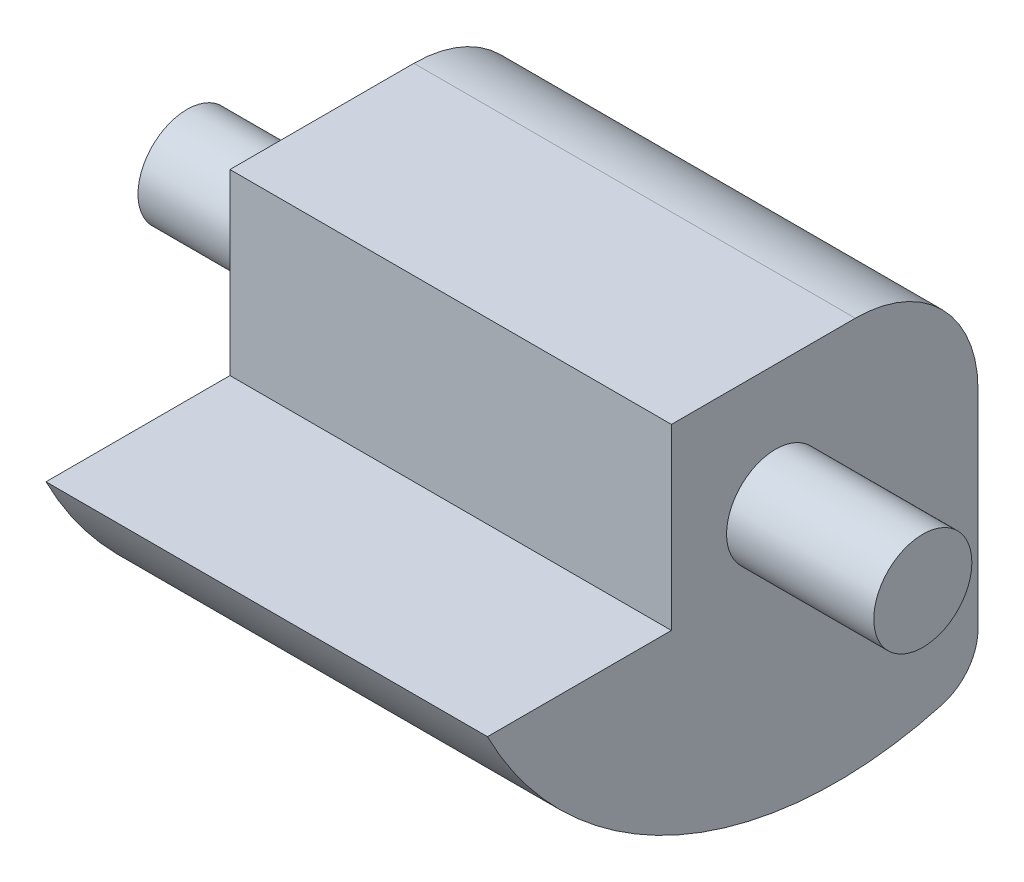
ISO-10303-21;
HEADER;
FILE_DESCRIPTION(('STEP AP214'),'2;1');
FILE_NAME('part.step','',(''),(''),'','','');
FILE_SCHEMA(('AUTOMOTIVE_DESIGN { 1 0 10303 214 1 1 1 1 }'));
ENDSEC;
DATA;
#1=APPLICATION_CONTEXT('core data for automotive mechanical design processes');
#2=APPLICATION_PROTOCOL_DEFINITION('international standard','automotive_design',2000,#1);
#3=PRODUCT_CONTEXT('',#1,'mechanical');
#4=PRODUCT('Part','Part','',(#3));
#5=PRODUCT_RELATED_PRODUCT_CATEGORY('part','',(#4));
#6=PRODUCT_DEFINITION_FORMATION('','',#4);
#7=PRODUCT_DEFINITION_CONTEXT('part definition',#1,'design');
#8=PRODUCT_DEFINITION('design','',#6,#7);
#9=PRODUCT_DEFINITION_SHAPE('','',#8);
#10=(LENGTH_UNIT() NAMED_UNIT(*) SI_UNIT(.MILLI.,.METRE.));
#11=(NAMED_UNIT(*) PLANE_ANGLE_UNIT() SI_UNIT($,.RADIAN.));
#12=(NAMED_UNIT(*) SI_UNIT($,.STERADIAN.) SOLID_ANGLE_UNIT());
#13=UNCERTAINTY_MEASURE_WITH_UNIT(LENGTH_MEASURE(1.E-05),#10,'distance_accuracy_value','');
#14=(GEOMETRIC_REPRESENTATION_CONTEXT(3) GLOBAL_UNCERTAINTY_ASSIGNED_CONTEXT((#13)) GLOBAL_UNIT_ASSIGNED_CONTEXT((#10,
#11,#12)) REPRESENTATION_CONTEXT('',''));
#15=CARTESIAN_POINT('',(0.,0.,0.));
#16=DIRECTION('',(0.,0.,1.));
#17=DIRECTION('',(1.,0.,0.));
#18=AXIS2_PLACEMENT_3D('',#15,#16,#17);
#19=CARTESIAN_POINT('',(1.82178280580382,25.230124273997,86.6124482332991));
#20=DIRECTION('',(0.,0.,1.));
#21=DIRECTION('',(1.,0.,0.));
#22=AXIS2_PLACEMENT_3D('',#19,#20,#21);
#23=PLANE('',#22);
#24=DIRECTION('',(1.,0.,0.));
#25=VECTOR('',#24,1.);
#26=CARTESIAN_POINT('',(1.82178280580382,17.9543081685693,86.6124482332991));
#27=LINE('',#26,#25);
#28=CARTESIAN_POINT('',(1.82178280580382,17.9543081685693,86.6124482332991));
#29=VERTEX_POINT('',#28);
#30=CARTESIAN_POINT('',(19.8217828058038,17.9543081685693,86.6124482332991));
#31=VERTEX_POINT('',#30);
#32=EDGE_CURVE('E90',#29,#31,#27,.T.);
#33=ORIENTED_EDGE('',*,*,#32,.T.);
#34=DIRECTION('',(0.,-1.,0.));
#35=VECTOR('',#34,1.);
#36=CARTESIAN_POINT('',(19.8217828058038,25.230124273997,86.6124482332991));
#37=LINE('',#36,#35);
#38=CARTESIAN_POINT('',(19.8217828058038,25.230124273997,86.6124482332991));
#39=VERTEX_POINT('',#38);
#40=EDGE_CURVE('E94',#39,#31,#37,.T.);
#41=ORIENTED_EDGE('',*,*,#40,.F.);
#42=DIRECTION('',(1.,0.,0.));
#43=VECTOR('',#42,1.);
#44=CARTESIAN_POINT('',(1.82178280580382,25.230124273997,86.6124482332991));
#45=LINE('',#44,#43);
#46=CARTESIAN_POINT('',(1.82178280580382,25.230124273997,86.6124482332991));
#47=VERTEX_POINT('',#46);
#48=EDGE_CURVE('E133',#47,#39,#45,.T.);
#49=ORIENTED_EDGE('',*,*,#48,.F.);
#50=DIRECTION('',(0.,-1.,0.));
#51=VECTOR('',#50,1.);
#52=CARTESIAN_POINT('',(1.82178280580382,25.230124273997,86.6124482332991));
#53=LINE('',#52,#51);
#54=EDGE_CURVE('E96',#47,#29,#53,.T.);
#55=ORIENTED_EDGE('',*,*,#54,.T.);
#56=EDGE_LOOP('',(#33,#41,#49,#55));
#57=FACE_BOUND('',#56,.T.);
#58=ADVANCED_FACE('F33',(#57),#23,.T.);
#59=CARTESIAN_POINT('',(1.82178280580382,25.230124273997,86.6124482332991));
#60=DIRECTION('',(0.,1.,0.));
#61=DIRECTION('',(0.,0.,1.));
#62=AXIS2_PLACEMENT_3D('',#59,#60,#61);
#63=PLANE('',#62);
#64=DIRECTION('',(0.,0.,1.));
#65=VECTOR('',#64,1.);
#66=CARTESIAN_POINT('',(19.8217828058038,25.230124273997,86.6124482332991));
#67=LINE('',#66,#65);
#68=CARTESIAN_POINT('',(19.8217828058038,25.230124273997,79.1124482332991));
#69=VERTEX_POINT('',#68);
#70=EDGE_CURVE('E111',#69,#39,#67,.T.);
#71=ORIENTED_EDGE('',*,*,#70,.F.);
#72=DIRECTION('',(1.,0.,0.));
#73=VECTOR('',#72,1.);
#74=CARTESIAN_POINT('',(1.82178280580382,25.230124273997,79.1124482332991));
#75=LINE('',#74,#73);
#76=CARTESIAN_POINT('',(1.82178280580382,25.230124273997,79.1124482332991));
#77=VERTEX_POINT('',#76);
#78=EDGE_CURVE('E144',#69,#77,#75,.F.);
#79=ORIENTED_EDGE('',*,*,#78,.T.);
#80=DIRECTION('',(0.,0.,1.));
#81=VECTOR('',#80,1.);
#82=CARTESIAN_POINT('',(1.82178280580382,25.230124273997,86.6124482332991));
#83=LINE('',#82,#81);
#84=EDGE_CURVE('E101',#77,#47,#83,.T.);
#85=ORIENTED_EDGE('',*,*,#84,.T.);
#86=ORIENTED_EDGE('',*,*,#48,.T.);
#87=EDGE_LOOP('',(#71,#79,#85,#86));
#88=FACE_BOUND('',#87,.T.);
#89=ADVANCED_FACE('F169',(#88),#63,.T.);
#90=CARTESIAN_POINT('',(1.82178280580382,25.230124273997,74.1124482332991));
#91=DIRECTION('',(0.,0.,-1.));
#92=DIRECTION('',(-1.,0.,0.));
#93=AXIS2_PLACEMENT_3D('',#90,#91,#92);
#94=PLANE('',#93);
#95=DIRECTION('',(0.,1.,0.));
#96=VECTOR('',#95,1.);
#97=CARTESIAN_POINT('',(19.8217828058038,25.230124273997,74.1124482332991));
#98=LINE('',#97,#96);
#99=CARTESIAN_POINT('',(19.8217828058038,11.7417033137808,74.1124482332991));
#100=VERTEX_POINT('',#99);
#101=CARTESIAN_POINT('',(19.8217828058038,20.230124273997,74.1124482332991));
#102=VERTEX_POINT('',#101);
#103=EDGE_CURVE('E121',#100,#102,#98,.T.);
#104=ORIENTED_EDGE('',*,*,#103,.F.);
#105=DIRECTION('',(1.,0.,0.));
#106=VECTOR('',#105,1.);
#107=CARTESIAN_POINT('',(1.82178280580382,11.7417033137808,74.1124482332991));
#108=LINE('',#107,#106);
#109=CARTESIAN_POINT('',(1.82178280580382,11.7417033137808,74.1124482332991));
#110=VERTEX_POINT('',#109);
#111=EDGE_CURVE('E41',#100,#110,#108,.F.);
#112=ORIENTED_EDGE('',*,*,#111,.T.);
#113=DIRECTION('',(0.,1.,0.));
#114=VECTOR('',#113,1.);
#115=CARTESIAN_POINT('',(1.82178280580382,25.230124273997,74.1124482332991));
#116=LINE('',#115,#114);
#117=CARTESIAN_POINT('',(1.82178280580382,20.230124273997,74.1124482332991));
#118=VERTEX_POINT('',#117);
#119=EDGE_CURVE('E130',#110,#118,#116,.T.);
#120=ORIENTED_EDGE('',*,*,#119,.T.);
#121=DIRECTION('',(1.,0.,0.));
#122=VECTOR('',#121,1.);
#123=CARTESIAN_POINT('',(1.82178280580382,20.230124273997,74.1124482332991));
#124=LINE('',#123,#122);
#125=EDGE_CURVE('E139',#118,#102,#124,.T.);
#126=ORIENTED_EDGE('',*,*,#125,.T.);
#127=EDGE_LOOP('',(#104,#112,#120,#126));
#128=FACE_BOUND('',#127,.T.);
#129=ADVANCED_FACE('F163',(#128),#94,.T.);
#130=CARTESIAN_POINT('',(1.82178280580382,25.230124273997,79.8624482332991));
#131=DIRECTION('',(1.,0.,0.));
#132=DIRECTION('',(0.,0.,-1.));
#133=AXIS2_PLACEMENT_3D('',#130,#131,#132);
#134=CYLINDRICAL_SURFACE('',#133,16.);
#135=CARTESIAN_POINT('',(1.82178280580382,25.230124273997,79.8624482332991));
#136=DIRECTION('',(1.,0.,0.));
#137=DIRECTION('',(0.,0.,-1.));
#138=AXIS2_PLACEMENT_3D('',#135,#136,#137);
#139=CIRCLE('',#138,16.);
#140=CARTESIAN_POINT('',(1.82178280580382,17.9543081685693,94.112448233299));
#141=VERTEX_POINT('',#140);
#142=CARTESIAN_POINT('',(1.82178280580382,9.81478603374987,75.5767339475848));
#143=VERTEX_POINT('',#142);
#144=EDGE_CURVE('E127',#141,#143,#139,.T.);
#145=ORIENTED_EDGE('',*,*,#144,.T.);
#146=DIRECTION('',(1.,0.,0.));
#147=VECTOR('',#146,1.);
#148=CARTESIAN_POINT('',(1.82178280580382,9.81478603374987,75.5767339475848));
#149=LINE('',#148,#147);
#150=CARTESIAN_POINT('',(19.8217828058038,9.81478603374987,75.5767339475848));
#151=VERTEX_POINT('',#150);
#152=EDGE_CURVE('E149',#143,#151,#149,.T.);
#153=ORIENTED_EDGE('',*,*,#152,.T.);
#154=CARTESIAN_POINT('',(19.8217828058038,25.230124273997,79.8624482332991));
#155=DIRECTION('',(1.,0.,0.));
#156=DIRECTION('',(0.,0.,-1.));
#157=AXIS2_PLACEMENT_3D('',#154,#155,#156);
#158=CIRCLE('',#157,16.);
#159=CARTESIAN_POINT('',(19.8217828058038,17.9543081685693,94.112448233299));
#160=VERTEX_POINT('',#159);
#161=EDGE_CURVE('E107',#160,#151,#158,.T.);
#162=ORIENTED_EDGE('',*,*,#161,.F.);
#163=DIRECTION('',(1.,0.,0.));
#164=VECTOR('',#163,1.);
#165=CARTESIAN_POINT('',(1.82178280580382,17.9543081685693,94.112448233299));
#166=LINE('',#165,#164);
#167=EDGE_CURVE('E100',#141,#160,#166,.T.);
#168=ORIENTED_EDGE('',*,*,#167,.F.);
#169=EDGE_LOOP('',(#145,#153,#162,#168));
#170=FACE_BOUND('',#169,.T.);
#171=ADVANCED_FACE('F154',(#170),#134,.T.);
#172=CARTESIAN_POINT('',(1.82178280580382,17.9543081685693,86.6124482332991));
#173=DIRECTION('',(0.,1.,0.));
#174=DIRECTION('',(0.,0.,1.));
#175=AXIS2_PLACEMENT_3D('',#172,#173,#174);
#176=PLANE('',#175);
#177=ORIENTED_EDGE('',*,*,#167,.T.);
#178=DIRECTION('',(0.,0.,1.));
#179=VECTOR('',#178,1.);
#180=CARTESIAN_POINT('',(19.8217828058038,17.9543081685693,86.6124482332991));
#181=LINE('',#180,#179);
#182=EDGE_CURVE('E104',#31,#160,#181,.T.);
#183=ORIENTED_EDGE('',*,*,#182,.F.);
#184=ORIENTED_EDGE('',*,*,#32,.F.);
#185=DIRECTION('',(0.,0.,1.));
#186=VECTOR('',#185,1.);
#187=CARTESIAN_POINT('',(1.82178280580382,17.9543081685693,86.6124482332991));
#188=LINE('',#187,#186);
#189=EDGE_CURVE('E125',#29,#141,#188,.T.);
#190=ORIENTED_EDGE('',*,*,#189,.T.);
#191=EDGE_LOOP('',(#177,#183,#184,#190));
#192=FACE_BOUND('',#191,.T.);
#193=ADVANCED_FACE('F105',(#192),#176,.T.);
#194=CARTESIAN_POINT('',(1.82178280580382,25.230124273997,79.8624482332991));
#195=DIRECTION('',(1.,0.,0.));
#196=DIRECTION('',(0.,0.,-1.));
#197=AXIS2_PLACEMENT_3D('',#194,#195,#196);
#198=PLANE('',#197);
#199=CARTESIAN_POINT('',(1.82178280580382,20.230124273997,82.3624482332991));
#200=DIRECTION('',(1.,0.,0.));
#201=DIRECTION('',(0.,0.,-1.));
#202=AXIS2_PLACEMENT_3D('',#199,#200,#201);
#203=CIRCLE('',#202,2.);
#204=CARTESIAN_POINT('',(1.82178280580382,20.230124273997,80.3624482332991));
#205=VERTEX_POINT('',#204);
#206=EDGE_CURVE('E135',#205,#205,#203,.F.);
#207=ORIENTED_EDGE('',*,*,#206,.F.);
#208=EDGE_LOOP('',(#207));
#209=FACE_BOUND('',#208,.T.);
#210=ORIENTED_EDGE('',*,*,#119,.F.);
#211=CARTESIAN_POINT('',(1.82178280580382,11.7417033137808,76.1124482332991));
#212=DIRECTION('',(1.,0.,0.));
#213=DIRECTION('',(0.,0.,-1.));
#214=AXIS2_PLACEMENT_3D('',#211,#212,#213);
#215=CIRCLE('',#214,2.);
#216=EDGE_CURVE('E11',#110,#143,#215,.F.);
#217=ORIENTED_EDGE('',*,*,#216,.T.);
#218=ORIENTED_EDGE('',*,*,#144,.F.);
#219=ORIENTED_EDGE('',*,*,#189,.F.);
#220=ORIENTED_EDGE('',*,*,#54,.F.);
#221=ORIENTED_EDGE('',*,*,#84,.F.);
#222=CARTESIAN_POINT('',(1.82178280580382,20.230124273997,79.1124482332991));
#223=DIRECTION('',(1.,0.,0.));
#224=DIRECTION('',(0.,0.,-1.));
#225=AXIS2_PLACEMENT_3D('',#222,#223,#224);
#226=CIRCLE('',#225,5.);
#227=EDGE_CURVE('E146',#77,#118,#226,.F.);
#228=ORIENTED_EDGE('',*,*,#227,.T.);
#229=EDGE_LOOP('',(#210,#217,#218,#219,#220,#221,#228));
#230=FACE_BOUND('',#229,.T.);
#231=ADVANCED_FACE('F159',(#209,#230),#198,.F.);
#232=CARTESIAN_POINT('',(19.8217828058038,25.230124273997,79.8624482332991));
#233=DIRECTION('',(1.,0.,0.));
#234=DIRECTION('',(0.,0.,-1.));
#235=AXIS2_PLACEMENT_3D('',#232,#233,#234);
#236=PLANE('',#235);
#237=CARTESIAN_POINT('',(19.8217828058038,20.230124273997,82.3624482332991));
#238=DIRECTION('',(1.,0.,0.));
#239=DIRECTION('',(0.,0.,-1.));
#240=AXIS2_PLACEMENT_3D('',#237,#238,#239);
#241=CIRCLE('',#240,2.);
#242=CARTESIAN_POINT('',(19.8217828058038,20.230124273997,80.3624482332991));
#243=VERTEX_POINT('',#242);
#244=EDGE_CURVE('E215',#243,#243,#241,.T.);
#245=ORIENTED_EDGE('',*,*,#244,.F.);
#246=EDGE_LOOP('',(#245));
#247=FACE_BOUND('',#246,.T.);
#248=ORIENTED_EDGE('',*,*,#161,.T.);
#249=CARTESIAN_POINT('',(19.8217828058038,11.7417033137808,76.1124482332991));
#250=DIRECTION('',(1.,0.,0.));
#251=DIRECTION('',(0.,0.,-1.));
#252=AXIS2_PLACEMENT_3D('',#249,#250,#251);
#253=CIRCLE('',#252,2.);
#254=EDGE_CURVE('E55',#151,#100,#253,.T.);
#255=ORIENTED_EDGE('',*,*,#254,.T.);
#256=ORIENTED_EDGE('',*,*,#103,.T.);
#257=CARTESIAN_POINT('',(19.8217828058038,20.230124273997,79.1124482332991));
#258=DIRECTION('',(1.,0.,0.));
#259=DIRECTION('',(0.,0.,-1.));
#260=AXIS2_PLACEMENT_3D('',#257,#258,#259);
#261=CIRCLE('',#260,5.);
#262=EDGE_CURVE('E142',#102,#69,#261,.T.);
#263=ORIENTED_EDGE('',*,*,#262,.T.);
#264=ORIENTED_EDGE('',*,*,#70,.T.);
#265=ORIENTED_EDGE('',*,*,#40,.T.);
#266=ORIENTED_EDGE('',*,*,#182,.T.);
#267=EDGE_LOOP('',(#248,#255,#256,#263,#264,#265,#266));
#268=FACE_BOUND('',#267,.T.);
#269=ADVANCED_FACE('F109',(#247,#268),#236,.T.);
#270=CARTESIAN_POINT('',(-4.17821719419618,20.230124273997,82.3624482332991));
#271=DIRECTION('',(1.,0.,0.));
#272=DIRECTION('',(0.,0.,-1.));
#273=AXIS2_PLACEMENT_3D('',#270,#271,#272);
#274=CYLINDRICAL_SURFACE('',#273,2.);
#275=CARTESIAN_POINT('',(-4.17821719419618,20.230124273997,82.3624482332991));
#276=DIRECTION('',(-1.,0.,0.));
#277=DIRECTION('',(0.,0.,1.));
#278=AXIS2_PLACEMENT_3D('',#275,#276,#277);
#279=CIRCLE('',#278,2.);
#280=CARTESIAN_POINT('',(-4.17821719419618,20.230124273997,84.3624482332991));
#281=VERTEX_POINT('',#280);
#282=EDGE_CURVE('E113',#281,#281,#279,.T.);
#283=ORIENTED_EDGE('',*,*,#282,.F.);
#284=EDGE_LOOP('',(#283));
#285=FACE_BOUND('',#284,.T.);
#286=ORIENTED_EDGE('',*,*,#206,.T.);
#287=EDGE_LOOP('',(#286));
#288=FACE_BOUND('',#287,.T.);
#289=ADVANCED_FACE('F203',(#285,#288),#274,.T.);
#290=CARTESIAN_POINT('',(-4.17821719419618,20.230124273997,82.3624482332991));
#291=DIRECTION('',(-1.,0.,0.));
#292=DIRECTION('',(0.,0.,1.));
#293=AXIS2_PLACEMENT_3D('',#290,#291,#292);
#294=PLANE('',#293);
#295=ORIENTED_EDGE('',*,*,#282,.T.);
#296=EDGE_LOOP('',(#295));
#297=FACE_BOUND('',#296,.T.);
#298=ADVANCED_FACE('F196',(#297),#294,.T.);
#299=CARTESIAN_POINT('',(25.8217828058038,20.230124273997,82.3624482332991));
#300=DIRECTION('',(-1.,0.,0.));
#301=DIRECTION('',(0.,0.,1.));
#302=AXIS2_PLACEMENT_3D('',#299,#300,#301);
#303=CYLINDRICAL_SURFACE('',#302,2.);
#304=CARTESIAN_POINT('',(25.8217828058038,20.230124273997,82.3624482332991));
#305=DIRECTION('',(1.,0.,0.));
#306=DIRECTION('',(0.,0.,-1.));
#307=AXIS2_PLACEMENT_3D('',#304,#305,#306);
#308=CIRCLE('',#307,2.);
#309=CARTESIAN_POINT('',(25.8217828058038,20.230124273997,80.3624482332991));
#310=VERTEX_POINT('',#309);
#311=EDGE_CURVE('E116',#310,#310,#308,.T.);
#312=ORIENTED_EDGE('',*,*,#311,.F.);
#313=EDGE_LOOP('',(#312));
#314=FACE_BOUND('',#313,.T.);
#315=ORIENTED_EDGE('',*,*,#244,.T.);
#316=EDGE_LOOP('',(#315));
#317=FACE_BOUND('',#316,.T.);
#318=ADVANCED_FACE('F190',(#314,#317),#303,.T.);
#319=CARTESIAN_POINT('',(25.8217828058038,20.230124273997,82.3624482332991));
#320=DIRECTION('',(1.,0.,0.));
#321=DIRECTION('',(0.,0.,-1.));
#322=AXIS2_PLACEMENT_3D('',#319,#320,#321);
#323=PLANE('',#322);
#324=ORIENTED_EDGE('',*,*,#311,.T.);
#325=EDGE_LOOP('',(#324));
#326=FACE_BOUND('',#325,.T.);
#327=ADVANCED_FACE('F185',(#326),#323,.T.);
#328=CARTESIAN_POINT('',(1.82178280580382,20.230124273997,79.1124482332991));
#329=DIRECTION('',(1.,0.,0.));
#330=DIRECTION('',(0.,0.,-1.));
#331=AXIS2_PLACEMENT_3D('',#328,#329,#330);
#332=CYLINDRICAL_SURFACE('',#331,5.);
#333=ORIENTED_EDGE('',*,*,#227,.F.);
#334=ORIENTED_EDGE('',*,*,#78,.F.);
#335=ORIENTED_EDGE('',*,*,#262,.F.);
#336=ORIENTED_EDGE('',*,*,#125,.F.);
#337=EDGE_LOOP('',(#333,#334,#335,#336));
#338=FACE_BOUND('',#337,.T.);
#339=ADVANCED_FACE('F166',(#338),#332,.T.);
#340=CARTESIAN_POINT('',(1.82178280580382,11.7417033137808,76.1124482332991));
#341=DIRECTION('',(1.,0.,0.));
#342=DIRECTION('',(0.,0.,-1.));
#343=AXIS2_PLACEMENT_3D('',#340,#341,#342);
#344=CYLINDRICAL_SURFACE('',#343,2.);
#345=ORIENTED_EDGE('',*,*,#216,.F.);
#346=ORIENTED_EDGE('',*,*,#111,.F.);
#347=ORIENTED_EDGE('',*,*,#254,.F.);
#348=ORIENTED_EDGE('',*,*,#152,.F.);
#349=EDGE_LOOP('',(#345,#346,#347,#348));
#350=FACE_BOUND('',#349,.T.);
#351=ADVANCED_FACE('F35',(#350),#344,.T.);
#352=CLOSED_SHELL('',(#58,#89,#129,#171,#193,#231,#269,#289,#298,#318,#327,#339,#351));
#353=MANIFOLD_SOLID_BREP('B2',#352);
#354=ADVANCED_BREP_SHAPE_REPRESENTATION('',(#18,#353),#14);
#355=SHAPE_DEFINITION_REPRESENTATION(#9,#354);
ENDSEC;
END-ISO-10303-21;
